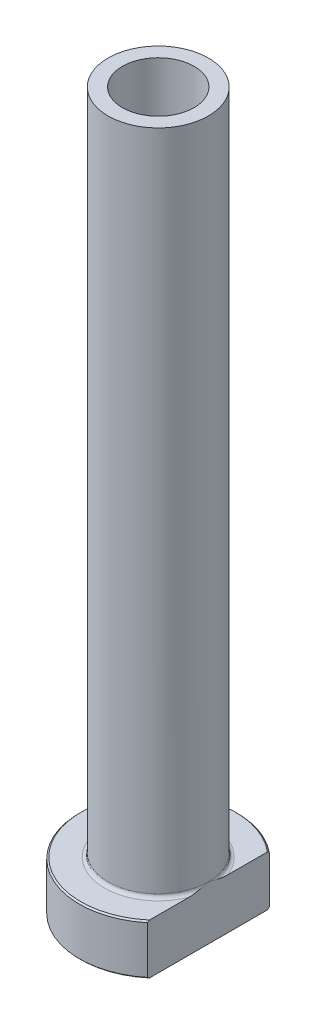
from build123d import *

# Parameters (mm, degrees)
FILLET1_R          = 0.5
CHAMFER1_SIZE      = 0.2
CUT_EXTRUDE1_DEPTH = 102.202766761
CHAMFER2_SIZE      = 0.5


with BuildPart() as part:
    # Sketch1 → Revolve1 (revolve)
    with BuildSketch(Plane.XY, mode=Mode.PRIVATE) as revolve1_sk:
        Polygon((-5, 100), (-7, 100), (-7, 7), (-11, 7), (-11, 0), (-5.25, 0), (-5.25, 43), (-5, 55), align=None)
    revolve(revolve1_sk.sketch.rotate(Axis((0, 92.187680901, 0), (0, -1, 0)), 270), axis=Axis((0, 92.187680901, 0), (0, -1, 0)))

    # Fillet1
    fillet1_edges = [part.edges().sort_by_distance(p)[0] for p in [
        (0, 7, -7),
    ]]
    fillet(fillet1_edges, radius=FILLET1_R)

    # Chamfer1
    chamfer1_edges = [part.edges().sort_by_distance(p)[0] for p in [
        (0, 0, -11),
        (0, 7, -11),
    ]]
    chamfer(chamfer1_edges, length=CHAMFER1_SIZE)

    # Sketch2 → Cut-Extrude1 (cut, through all)
    with BuildSketch(Plane.XZ):
        with BuildLine():
            Line((7, 8.485281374), (7, -8.485281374))
            ThreePointArc((7, -8.485281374), (11, 0), (7, 8.485281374))
        make_face()
    extrude(amount=-CUT_EXTRUDE1_DEPTH, mode=Mode.SUBTRACT)

    # Chamfer2
    chamfer2_edges = [part.edges().sort_by_distance(p)[0] for p in [
        (0, 0, -5.25),
    ]]
    chamfer(chamfer2_edges, length=CHAMFER2_SIZE)


solid = part.part
